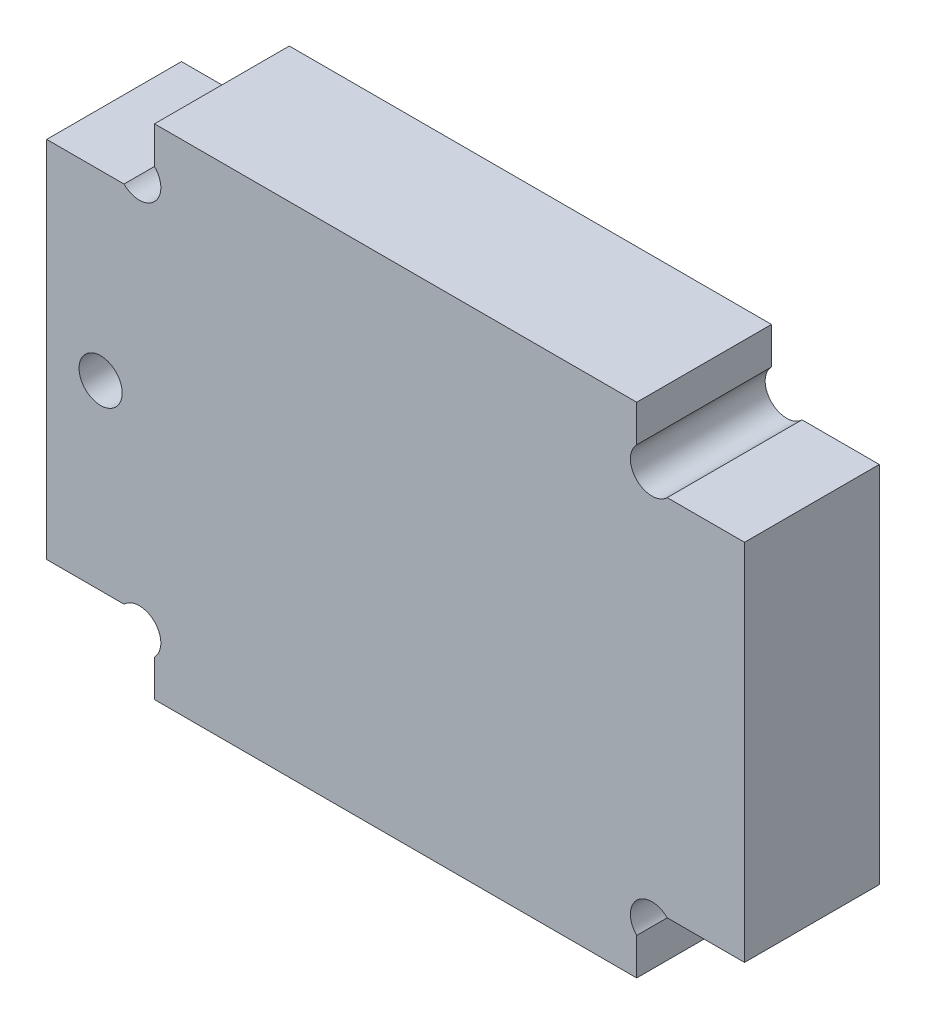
from build123d import *

# Parameters (mm, degrees)
ESQUISSE1_W             = 35.78
ESQUISSE1_H             = 37
BOSS_EXTRU_1_DEPTH      = 10
ESQUISSE3_W             = 10
ESQUISSE3_H             = 27
BOSS_EXTRU_2_DEPTH      = 8
ESQUISSE4_W             = 10
ESQUISSE4_H             = 27
BOSS_EXTRU_3_DEPTH      = 8
ENL_V_MAT_EXTRU_1_DEPTH = 10
ESQUISSE6_R             = 1.6
ENL_V_MAT_EXTRU_2_DEPTH = 10


with BuildPart() as part:
    # Esquisse1 → Boss.-Extru.1 (new body)
    with BuildSketch(Plane.XY):
        Rectangle(ESQUISSE1_W, ESQUISSE1_H)
    extrude(amount=BOSS_EXTRU_1_DEPTH)

    # Esquisse3 → Boss.-Extru.2 (add)
    with BuildSketch(Plane(origin=(17.89, 0, 0), x_dir=(0, 0, -1), z_dir=(1, 0, 0))):
        with Locations((-5, 0)):
            Rectangle(ESQUISSE3_W, ESQUISSE3_H)
    extrude(amount=BOSS_EXTRU_2_DEPTH)

    # Esquisse4 → Boss.-Extru.3 (add)
    with BuildSketch(Plane.ZY.offset(17.89)):
        with Locations((5, 0)):
            Rectangle(ESQUISSE4_W, ESQUISSE4_H)
    extrude(amount=BOSS_EXTRU_3_DEPTH)

    # Esquisse5 → Enl_v. mat.-Extru.1 (cut)
    with BuildSketch(Plane.XY.offset(10)):
        with BuildLine():
            Line((-17.89, 15.7627417), (-20.1527417, 13.5))
            ThreePointArc((-20.1527417, 13.5), (-17.89, 13.5), (-17.89, 15.7627417))
        make_face()
        with BuildLine():
            Line((17.89, 15.7627417), (20.1527417, 13.5))
            ThreePointArc((20.1527417, 13.5), (17.89, 13.5), (17.89, 15.7627417))
        make_face()
        with BuildLine():
            Line((-20.1527417, -13.5), (-17.89, -15.7627417))
            ThreePointArc((-17.89, -15.7627417), (-17.89, -13.5), (-20.1527417, -13.5))
        make_face()
        with BuildLine():
            Line((20.1527417, -13.5), (17.89, -15.7627417))
            ThreePointArc((17.89, -15.7627417), (17.89, -13.5), (20.1527417, -13.5))
        make_face()
    extrude(amount=-ENL_V_MAT_EXTRU_1_DEPTH, mode=Mode.SUBTRACT)

    # Esquisse6 → Enl_v. mat.-Extru.2 (cut)
    with BuildSketch(Plane.XY.offset(10)):
        with Locations((-21.89, 0)):
            Circle(ESQUISSE6_R)
    extrude(amount=-ENL_V_MAT_EXTRU_2_DEPTH, mode=Mode.SUBTRACT)


solid = part.part
